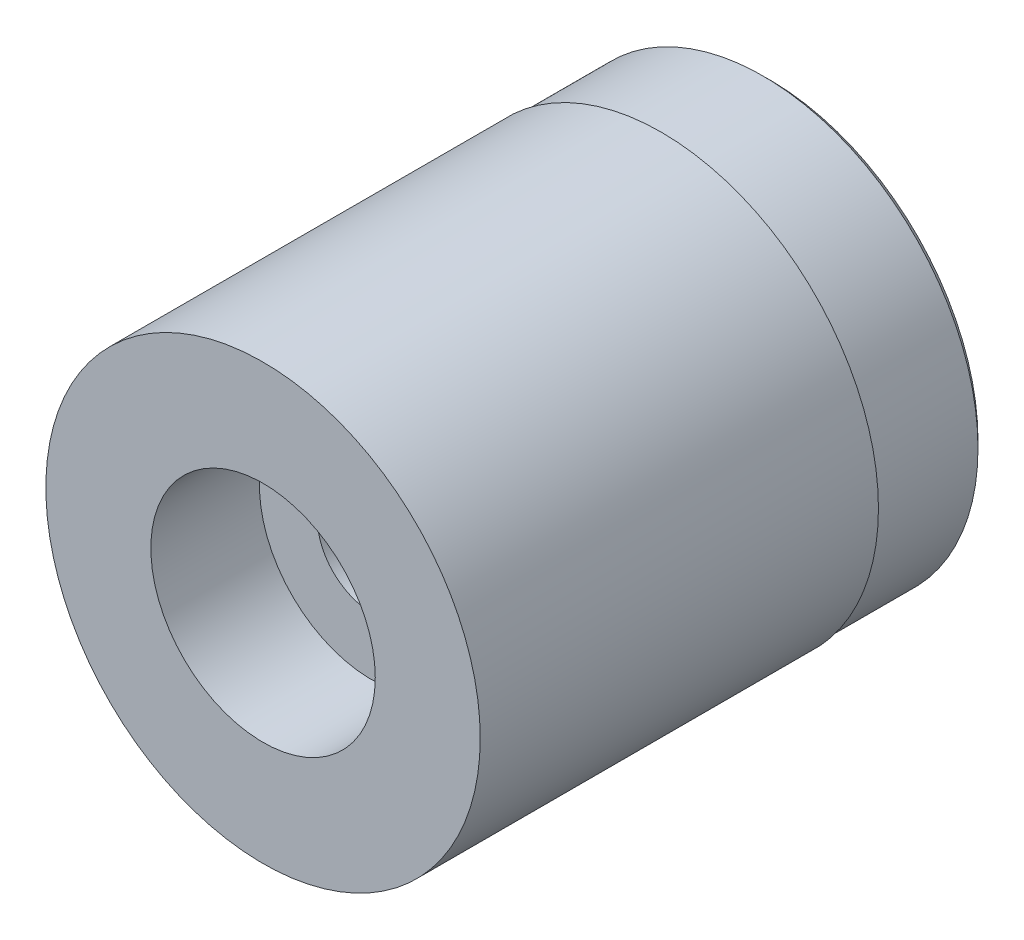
ISO-10303-21;
HEADER;
FILE_DESCRIPTION(('STEP AP214'),'2;1');
FILE_NAME('part.step','',(''),(''),'','','');
FILE_SCHEMA(('AUTOMOTIVE_DESIGN { 1 0 10303 214 1 1 1 1 }'));
ENDSEC;
DATA;
#1=APPLICATION_CONTEXT('core data for automotive mechanical design processes');
#2=APPLICATION_PROTOCOL_DEFINITION('international standard','automotive_design',2000,#1);
#3=PRODUCT_CONTEXT('',#1,'mechanical');
#4=PRODUCT('Part','Part','',(#3));
#5=PRODUCT_RELATED_PRODUCT_CATEGORY('part','',(#4));
#6=PRODUCT_DEFINITION_FORMATION('','',#4);
#7=PRODUCT_DEFINITION_CONTEXT('part definition',#1,'design');
#8=PRODUCT_DEFINITION('design','',#6,#7);
#9=PRODUCT_DEFINITION_SHAPE('','',#8);
#10=(LENGTH_UNIT() NAMED_UNIT(*) SI_UNIT(.MILLI.,.METRE.));
#11=(NAMED_UNIT(*) PLANE_ANGLE_UNIT() SI_UNIT($,.RADIAN.));
#12=(NAMED_UNIT(*) SI_UNIT($,.STERADIAN.) SOLID_ANGLE_UNIT());
#13=UNCERTAINTY_MEASURE_WITH_UNIT(LENGTH_MEASURE(1.E-05),#10,'distance_accuracy_value','');
#14=(GEOMETRIC_REPRESENTATION_CONTEXT(3) GLOBAL_UNCERTAINTY_ASSIGNED_CONTEXT((#13)) GLOBAL_UNIT_ASSIGNED_CONTEXT((#10,
#11,#12)) REPRESENTATION_CONTEXT('',''));
#15=CARTESIAN_POINT('',(0.,0.,0.));
#16=DIRECTION('',(0.,0.,1.));
#17=DIRECTION('',(1.,0.,0.));
#18=AXIS2_PLACEMENT_3D('',#15,#16,#17);
#19=CARTESIAN_POINT('',(0.,0.,3.79790950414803));
#20=DIRECTION('',(0.,0.,1.));
#21=DIRECTION('',(1.,0.,0.));
#22=AXIS2_PLACEMENT_3D('',#19,#20,#21);
#23=CYLINDRICAL_SURFACE('',#22,6.);
#24=CARTESIAN_POINT('',(0.,0.,0.));
#25=DIRECTION('',(0.,0.,1.));
#26=DIRECTION('',(1.,0.,0.));
#27=AXIS2_PLACEMENT_3D('',#24,#25,#26);
#28=CIRCLE('',#27,6.);
#29=CARTESIAN_POINT('',(6.,0.,0.));
#30=VERTEX_POINT('',#29);
#31=EDGE_CURVE('E10',#30,#30,#28,.T.);
#32=ORIENTED_EDGE('',*,*,#31,.F.);
#33=EDGE_LOOP('',(#32));
#34=FACE_BOUND('',#33,.T.);
#35=CARTESIAN_POINT('',(0.,0.,-11.));
#36=DIRECTION('',(0.,0.,-1.));
#37=DIRECTION('',(-1.,0.,0.));
#38=AXIS2_PLACEMENT_3D('',#35,#36,#37);
#39=CIRCLE('',#38,6.);
#40=CARTESIAN_POINT('',(-6.,0.,-11.));
#41=VERTEX_POINT('',#40);
#42=EDGE_CURVE('E35',#41,#41,#39,.T.);
#43=ORIENTED_EDGE('',*,*,#42,.F.);
#44=EDGE_LOOP('',(#43));
#45=FACE_BOUND('',#44,.T.);
#46=ADVANCED_FACE('F32',(#34,#45),#23,.T.);
#47=CARTESIAN_POINT('',(0.,0.,-14.));
#48=DIRECTION('',(0.,0.,1.));
#49=DIRECTION('',(1.,0.,0.));
#50=AXIS2_PLACEMENT_3D('',#47,#48,#49);
#51=CONICAL_SURFACE('',#50,5.7499999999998,0.785398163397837);
#52=CARTESIAN_POINT('',(0.,0.,-14.));
#53=DIRECTION('',(0.,0.,1.));
#54=DIRECTION('',(1.,0.,0.));
#55=AXIS2_PLACEMENT_3D('',#52,#53,#54);
#56=CIRCLE('',#55,5.7499999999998);
#57=CARTESIAN_POINT('',(5.7499999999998,0.,-14.));
#58=VERTEX_POINT('',#57);
#59=EDGE_CURVE('E53',#58,#58,#56,.T.);
#60=ORIENTED_EDGE('',*,*,#59,.T.);
#61=EDGE_LOOP('',(#60));
#62=FACE_BOUND('',#61,.T.);
#63=CARTESIAN_POINT('',(0.,0.,-13.8149999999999));
#64=DIRECTION('',(0.,0.,1.));
#65=DIRECTION('',(1.,0.,0.));
#66=AXIS2_PLACEMENT_3D('',#63,#64,#65);
#67=CIRCLE('',#66,5.935);
#68=CARTESIAN_POINT('',(5.935,0.,-13.8149999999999));
#69=VERTEX_POINT('',#68);
#70=EDGE_CURVE('E47',#69,#69,#67,.T.);
#71=ORIENTED_EDGE('',*,*,#70,.F.);
#72=EDGE_LOOP('',(#71));
#73=FACE_BOUND('',#72,.T.);
#74=ADVANCED_FACE('F79',(#62,#73),#51,.T.);
#75=CARTESIAN_POINT('',(0.,6.,0.));
#76=DIRECTION('',(0.,0.,-1.));
#77=DIRECTION('',(-1.,0.,0.));
#78=AXIS2_PLACEMENT_3D('',#75,#76,#77);
#79=PLANE('',#78);
#80=CARTESIAN_POINT('',(0.,0.,0.));
#81=DIRECTION('',(0.,0.,1.));
#82=DIRECTION('',(1.,0.,0.));
#83=AXIS2_PLACEMENT_3D('',#80,#81,#82);
#84=CIRCLE('',#83,3.1);
#85=CARTESIAN_POINT('',(3.1,0.,0.));
#86=VERTEX_POINT('',#85);
#87=EDGE_CURVE('E39',#86,#86,#84,.T.);
#88=ORIENTED_EDGE('',*,*,#87,.F.);
#89=EDGE_LOOP('',(#88));
#90=FACE_BOUND('',#89,.T.);
#91=ORIENTED_EDGE('',*,*,#31,.T.);
#92=EDGE_LOOP('',(#91));
#93=FACE_BOUND('',#92,.T.);
#94=ADVANCED_FACE('F74',(#90,#93),#79,.F.);
#95=CARTESIAN_POINT('',(0.,0.,3.79790950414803));
#96=DIRECTION('',(0.,0.,1.));
#97=DIRECTION('',(1.,0.,0.));
#98=AXIS2_PLACEMENT_3D('',#95,#96,#97);
#99=CYLINDRICAL_SURFACE('',#98,3.1);
#100=CARTESIAN_POINT('',(0.,0.,-3.));
#101=DIRECTION('',(0.,0.,1.));
#102=DIRECTION('',(1.,0.,0.));
#103=AXIS2_PLACEMENT_3D('',#100,#101,#102);
#104=CIRCLE('',#103,3.1);
#105=CARTESIAN_POINT('',(3.1,0.,-3.));
#106=VERTEX_POINT('',#105);
#107=EDGE_CURVE('E44',#106,#106,#104,.T.);
#108=ORIENTED_EDGE('',*,*,#107,.F.);
#109=EDGE_LOOP('',(#108));
#110=FACE_BOUND('',#109,.T.);
#111=ORIENTED_EDGE('',*,*,#87,.T.);
#112=EDGE_LOOP('',(#111));
#113=FACE_BOUND('',#112,.T.);
#114=ADVANCED_FACE('F71',(#110,#113),#99,.F.);
#115=CARTESIAN_POINT('',(0.,3.1,-3.));
#116=DIRECTION('',(0.,0.,-1.));
#117=DIRECTION('',(-1.,0.,0.));
#118=AXIS2_PLACEMENT_3D('',#115,#116,#117);
#119=PLANE('',#118);
#120=CARTESIAN_POINT('',(0.,0.,-3.));
#121=DIRECTION('',(0.,0.,1.));
#122=DIRECTION('',(1.,0.,0.));
#123=AXIS2_PLACEMENT_3D('',#120,#121,#122);
#124=CIRCLE('',#123,1.5);
#125=CARTESIAN_POINT('',(1.5,0.,-3.));
#126=VERTEX_POINT('',#125);
#127=EDGE_CURVE('E64',#126,#126,#124,.T.);
#128=ORIENTED_EDGE('',*,*,#127,.F.);
#129=EDGE_LOOP('',(#128));
#130=FACE_BOUND('',#129,.T.);
#131=ORIENTED_EDGE('',*,*,#107,.T.);
#132=EDGE_LOOP('',(#131));
#133=FACE_BOUND('',#132,.T.);
#134=ADVANCED_FACE('F69',(#130,#133),#119,.F.);
#135=CARTESIAN_POINT('',(0.,0.,3.79790950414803));
#136=DIRECTION('',(0.,0.,1.));
#137=DIRECTION('',(1.,0.,0.));
#138=AXIS2_PLACEMENT_3D('',#135,#136,#137);
#139=CYLINDRICAL_SURFACE('',#138,1.5);
#140=CARTESIAN_POINT('',(0.,0.,-14.));
#141=DIRECTION('',(0.,0.,1.));
#142=DIRECTION('',(1.,0.,0.));
#143=AXIS2_PLACEMENT_3D('',#140,#141,#142);
#144=CIRCLE('',#143,1.5);
#145=CARTESIAN_POINT('',(1.5,0.,-14.));
#146=VERTEX_POINT('',#145);
#147=EDGE_CURVE('E61',#146,#146,#144,.T.);
#148=ORIENTED_EDGE('',*,*,#147,.F.);
#149=EDGE_LOOP('',(#148));
#150=FACE_BOUND('',#149,.T.);
#151=ORIENTED_EDGE('',*,*,#127,.T.);
#152=EDGE_LOOP('',(#151));
#153=FACE_BOUND('',#152,.T.);
#154=ADVANCED_FACE('F103',(#150,#153),#139,.F.);
#155=CARTESIAN_POINT('',(0.,1.5,-14.));
#156=DIRECTION('',(0.,0.,1.));
#157=DIRECTION('',(1.,0.,0.));
#158=AXIS2_PLACEMENT_3D('',#155,#156,#157);
#159=PLANE('',#158);
#160=ORIENTED_EDGE('',*,*,#59,.F.);
#161=EDGE_LOOP('',(#160));
#162=FACE_BOUND('',#161,.T.);
#163=ORIENTED_EDGE('',*,*,#147,.T.);
#164=EDGE_LOOP('',(#163));
#165=FACE_BOUND('',#164,.T.);
#166=ADVANCED_FACE('F95',(#162,#165),#159,.F.);
#167=CARTESIAN_POINT('',(0.,6.935,-11.));
#168=DIRECTION('',(0.,0.,-1.));
#169=DIRECTION('',(-1.,0.,0.));
#170=AXIS2_PLACEMENT_3D('',#167,#168,#169);
#171=PLANE('',#170);
#172=CARTESIAN_POINT('',(0.,0.,-11.));
#173=DIRECTION('',(0.,0.,1.));
#174=DIRECTION('',(1.,0.,0.));
#175=AXIS2_PLACEMENT_3D('',#172,#173,#174);
#176=CIRCLE('',#175,5.935);
#177=CARTESIAN_POINT('',(5.935,0.,-11.));
#178=VERTEX_POINT('',#177);
#179=EDGE_CURVE('E49',#178,#178,#176,.T.);
#180=ORIENTED_EDGE('',*,*,#179,.T.);
#181=EDGE_LOOP('',(#180));
#182=FACE_BOUND('',#181,.T.);
#183=ORIENTED_EDGE('',*,*,#42,.T.);
#184=EDGE_LOOP('',(#183));
#185=FACE_BOUND('',#184,.T.);
#186=ADVANCED_FACE('F92',(#182,#185),#171,.T.);
#187=CARTESIAN_POINT('',(0.,0.,0.));
#188=DIRECTION('',(0.,0.,1.));
#189=DIRECTION('',(1.,0.,0.));
#190=AXIS2_PLACEMENT_3D('',#187,#188,#189);
#191=CYLINDRICAL_SURFACE('',#190,5.935);
#192=ORIENTED_EDGE('',*,*,#179,.F.);
#193=EDGE_LOOP('',(#192));
#194=FACE_BOUND('',#193,.T.);
#195=ORIENTED_EDGE('',*,*,#70,.T.);
#196=EDGE_LOOP('',(#195));
#197=FACE_BOUND('',#196,.T.);
#198=ADVANCED_FACE('F94',(#194,#197),#191,.T.);
#199=CLOSED_SHELL('',(#46,#74,#94,#114,#134,#154,#166,#186,#198));
#200=MANIFOLD_SOLID_BREP('B2',#199);
#201=ADVANCED_BREP_SHAPE_REPRESENTATION('',(#18,#200),#14);
#202=SHAPE_DEFINITION_REPRESENTATION(#9,#201);
ENDSEC;
END-ISO-10303-21;
